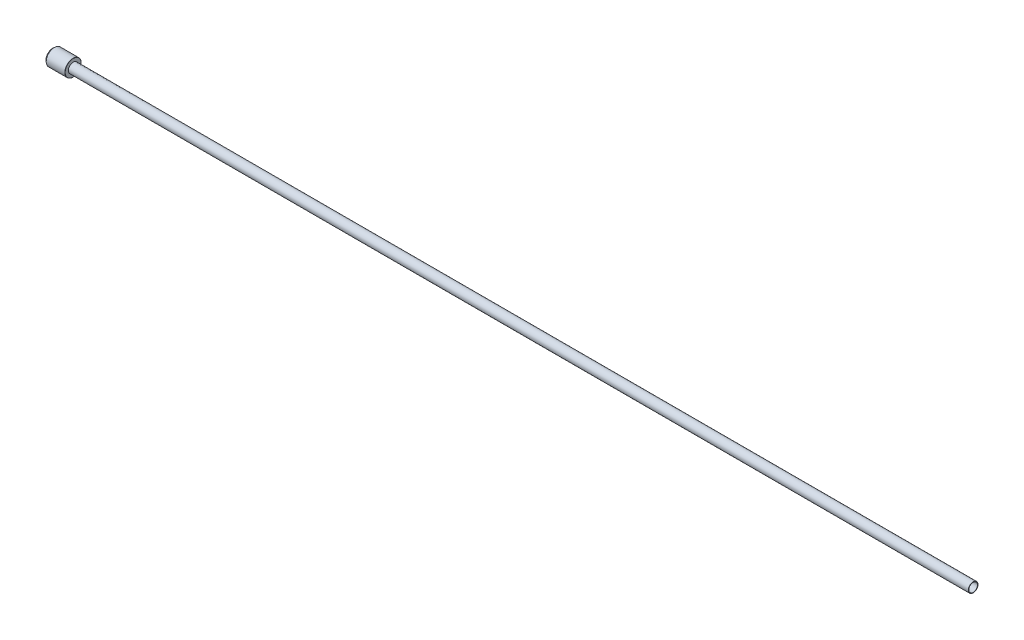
from build123d import *

# Parameters (mm, degrees)
FILLET2_R = 0.1


with BuildPart() as part:
    # Sketch1 → Revolve1 (revolve)
    with BuildSketch(Plane.XY, mode=Mode.PRIVATE) as revolve1_sk:
        Polygon((0.8045, 4), (8, 4), (10, 4), (10, 2.3749), (450, 2.3749), (450, 2.1209), (0, 2.1209), (0, 3.2955), (0.1, 3.2955), align=None)
    revolve(revolve1_sk.sketch.rotate(Axis((-22.212185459, 0, 0), (1, 0, 0)), 90), axis=Axis((-22.212185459, 0, 0), (1, 0, 0)))

    # Fillet2
    fillet2_edges = [part.edges().sort_by_distance(p)[0] for p in [
        (10, 0, -4),
    ]]
    fillet(fillet2_edges, radius=FILLET2_R)


solid = part.part
